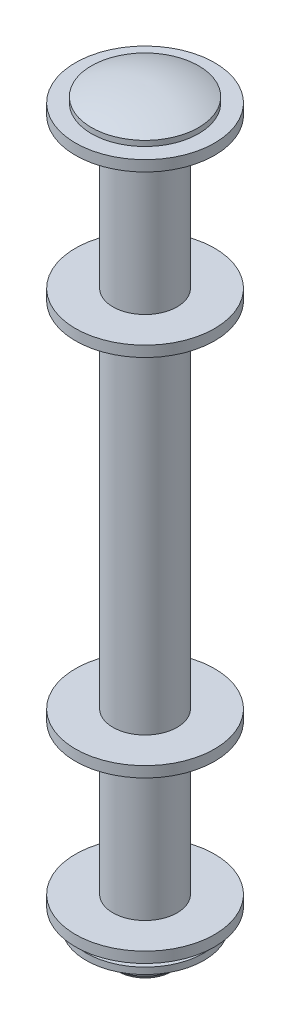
from build123d import *


with BuildPart() as part:
    # Sketch 2 → Revolve 1 (revolve)
    with BuildSketch(Plane.XY):
        with BuildLine():
            Line((0, 0), (0, 70.5))
            ThreePointArc((0, 70.5), (2.554886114, 70.274430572), (5, 69.5))
            Line((5, 69.5), (5, 69))
            Line((5, 69), (6.5, 69))
            Line((6.5, 69), (6.5, 68))
            Line((6.5, 68), (3, 68))
            Line((3, 68), (3, 54))
            Line((3, 54), (6.5, 54))
            Line((6.5, 54), (6.5, 53))
            Line((6.5, 53), (3, 53))
            Line((3, 53), (3, 20))
            Line((3, 20), (6.5, 20))
            Line((6.5, 20), (6.5, 19))
            Line((6.5, 19), (3, 19))
            Line((3, 19), (3, 5))
            Line((3, 5), (6.5, 5))
            Line((6.5, 5), (6.5, 4))
            Line((6.5, 4), (3, 4))
            Line((3, 4), (3, 3))
            Line((3, 3), (5.5, 3))
            Line((5.5, 3), (5.5, 2.4))
            Line((5.5, 2.4), (2.5, 2.4))
            Line((2.5, 2.4), (2.5, 2.3))
            Line((2.5, 2.3), (3, 2.3))
            Line((3, 2.3), (3, 0.5))
            Line((3, 0.5), (2.5, 0))
            Line((2.5, 0), (0, 0))
        make_face()
    revolve(axis=Axis((0, 0, 0), (0, 1, 0)))


solid = part.part
